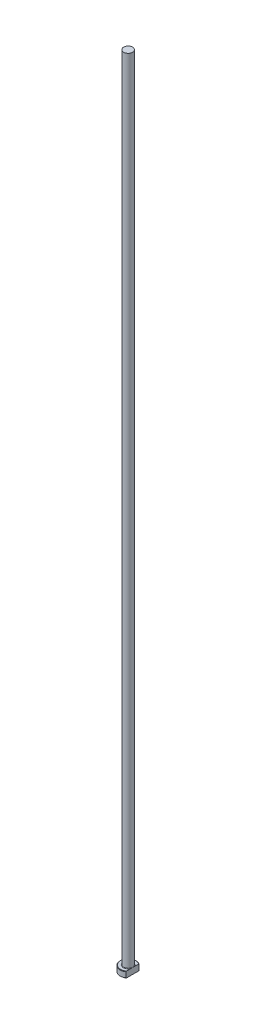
from build123d import *
from build123d.topology import SkipClean

# Parameters (mm, degrees)
CHAMFER1_SIZE = 0.2
FILLET1_R     = 0.2
KEY_DEPTH     = 401.039998


with BuildPart() as part:
    # Sketch1 → Revolve1 (revolve)
    with BuildSketch(Plane.XY, mode=Mode.PRIVATE) as revolve1_sk:
        Polygon((0, 0), (-4, 0), (-4, 3), (-2.25, 3), (-2.25, 400), (0, 400), align=None)
    revolve(revolve1_sk.sketch.rotate(Axis((0, 259.958771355, 0), (0, -1, 0)), 270), axis=Axis((0, 259.958771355, 0), (0, -1, 0)))

    # Chamfer1
    chamfer1_edges = [part.edges().sort_by_distance(p)[0] for p in [
        (0, 3, -4),
        (0, 0, -4),
    ]]
    chamfer(chamfer1_edges, length=CHAMFER1_SIZE)

    # Fillet1
    fillet1_edges = [part.edges().sort_by_distance(p)[0] for p in [
        (0, 3, -2.25),
    ]]
    fillet(fillet1_edges, radius=FILLET1_R)

    # Sketch2 → KEY (cut, through all)
    with SkipClean():  # the faces are left unmerged after this step: merging them gives an invalid solid
        with BuildSketch(Plane(origin=(0, 0, 0), x_dir=(1, 0, 0), z_dir=(0, 1, 0))):
            with BuildLine():
                Line((2.25, 3.307189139), (2.25, -3.307189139))
                ThreePointArc((2.25, -3.307189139), (4, 0), (2.25, 3.307189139))
            make_face()
        extrude(amount=KEY_DEPTH, mode=Mode.SUBTRACT)


solid = part.part
